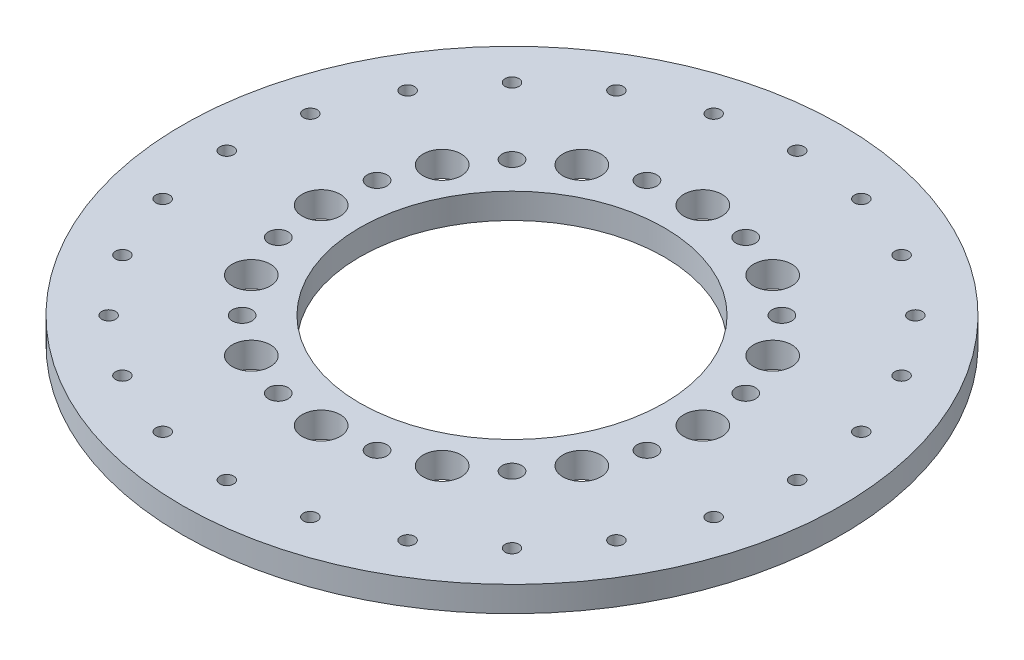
from build123d import *

# Parameters (mm, degrees)
SKETCH1_R                    = 82.55
SKETCH1_R_2                  = 38.1
BOSS_EXTRUDE1_DEPTH          = 6.35
F_8_32_TAPPED_HOLE1_D        = 3.4544
CIRPATTERN1_COUNT            = 24
F_3_8_0_375_DIAMETER_HOLE1_D = 9.525
CIRPATTERN2_COUNT            = 12
F_10_0_1935_DIAMETER_HOLE1_D = 4.9149
CIRPATTERN3_COUNT            = 12


with BuildPart() as part:
    # Sketch1 → Boss-Extrude1 (new body)
    with BuildSketch(Plane(origin=(0, 0, 0), x_dir=(1, 0, 0), z_dir=(0, 1, 0))):
        with Locations(Location((0, 0, 0), (0, 0, 270))):
            Circle(SKETCH1_R)
        with Locations(Location((0, 0, 0), (0, 0, 270))):
            Circle(SKETCH1_R_2, mode=Mode.SUBTRACT)
    extrude(amount=-BOSS_EXTRUDE1_DEPTH)

    # 8-32 Tapped Hole1 (through all)
    with Locations(Plane(origin=(0, 0, 0), x_dir=(1, 0, 0), z_dir=(0, 1, 0))):
        with Locations((0, 71.4375)):
            f_8_32_tapped_hole1 = Hole(F_8_32_TAPPED_HOLE1_D / 2)

    # CirPattern1: 8-32 Tapped Hole1 ×24 about axis
    cirpattern1_axis = Axis((0, 0, 0), (0, 1, 0))
    for i in range(1, CIRPATTERN1_COUNT):
        add(f_8_32_tapped_hole1.rotate(cirpattern1_axis, i * 360 / CIRPATTERN1_COUNT), mode=Mode.SUBTRACT)

    # 3_8 _0.375_ Diameter Hole1 (through all)
    with Locations(Plane(origin=(0, 0, 0), x_dir=(1, 0, 0), z_dir=(0, 1, 0))):
        with Locations((0, 47.8028)):
            f_3_8_0_375_diameter_hole1 = Hole(F_3_8_0_375_DIAMETER_HOLE1_D / 2)

    # CirPattern2: 3_8 _0.375_ Diameter Hole1 ×12 about axis
    cirpattern2_axis = Axis((0, 0, 0), (0, 1, 0))
    for i in range(1, CIRPATTERN2_COUNT):
        add(f_3_8_0_375_diameter_hole1.rotate(cirpattern2_axis, i * 360 / CIRPATTERN2_COUNT), mode=Mode.SUBTRACT)

    # 10 _0.1935_ Diameter Hole1 (through all)
    with Locations(Plane(origin=(0, 0, 0), x_dir=(1, 0, 0), z_dir=(0, 1, 0))):
        with Locations((-33.80168404, 33.80168404)):
            f_10_0_1935_diameter_hole1 = Hole(F_10_0_1935_DIAMETER_HOLE1_D / 2)

    # CirPattern3: 10 _0.1935_ Diameter Hole1 ×12 about axis
    cirpattern3_axis = Axis((0, 0, 0), (0, 1, 0))
    for i in range(1, CIRPATTERN3_COUNT):
        add(f_10_0_1935_diameter_hole1.rotate(cirpattern3_axis, i * 360 / CIRPATTERN3_COUNT), mode=Mode.SUBTRACT)


solid = part.part
